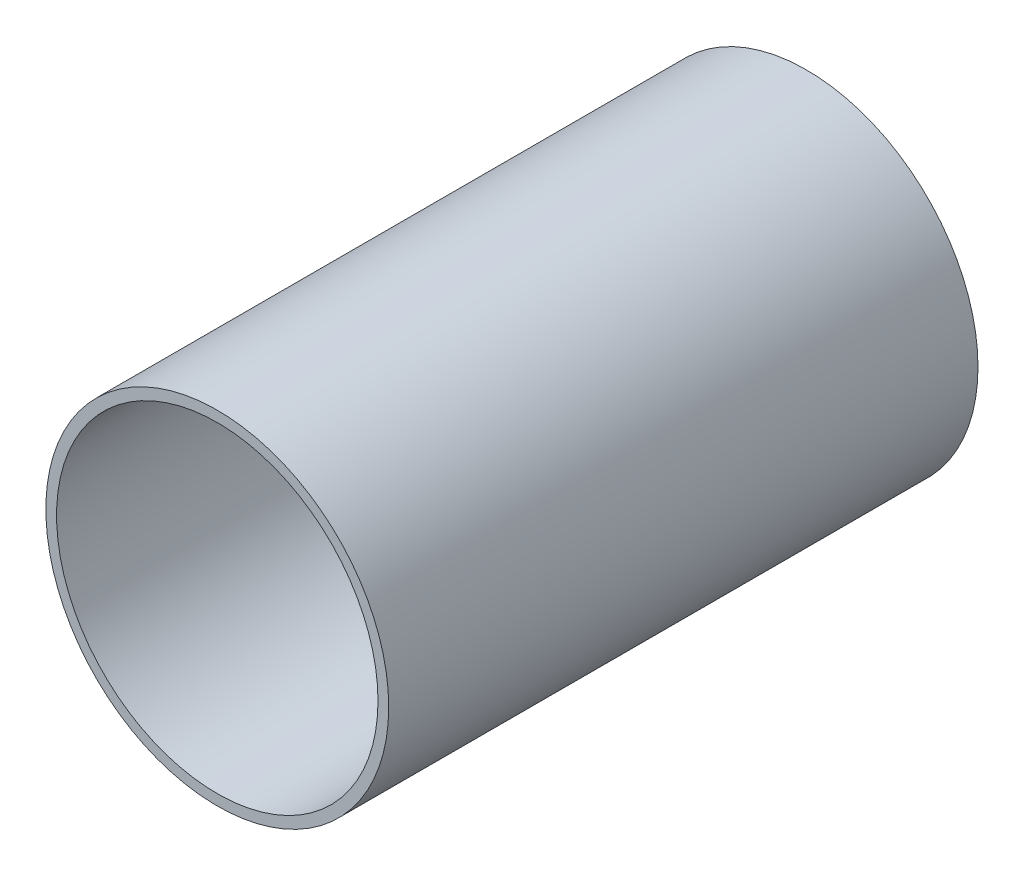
from build123d import *

# Parameters (mm, degrees)
SKETCH1_R           = 6.4
SKETCH1_R_2         = 6
BOSS_EXTRUDE1_DEPTH = 22


with BuildPart() as part:
    # Sketch1 → Boss-Extrude1 (new body)
    with BuildSketch(Plane.XY):
        Circle(SKETCH1_R)
        Circle(SKETCH1_R_2, mode=Mode.SUBTRACT)
    extrude(amount=BOSS_EXTRUDE1_DEPTH)


solid = part.part
